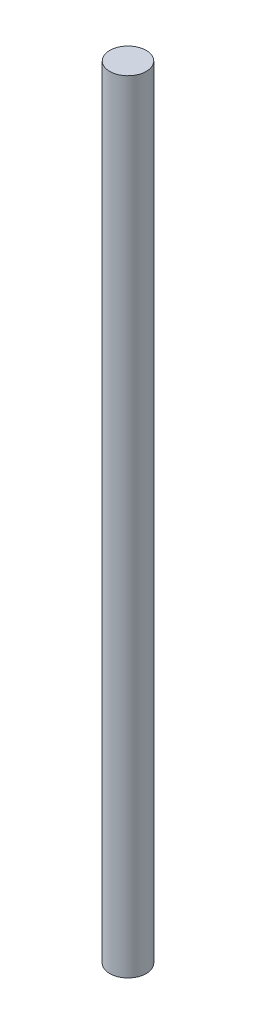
from build123d import *

# Parameters (mm, degrees)
SKETCH_1_R      = 1.75
EXTRUDE_1_DEPTH = 75


with BuildPart() as part:
    # Sketch 1 → Extrude 1 (new body)
    with BuildSketch(Plane(origin=(0, 0, 0), x_dir=(1, 0, 0), z_dir=(0, 1, 0))):
        with Locations(Location((-0.882259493, 0.735216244, 0), (0, 0, 270))):
            Circle(SKETCH_1_R)
    extrude(amount=EXTRUDE_1_DEPTH)


solid = part.part
